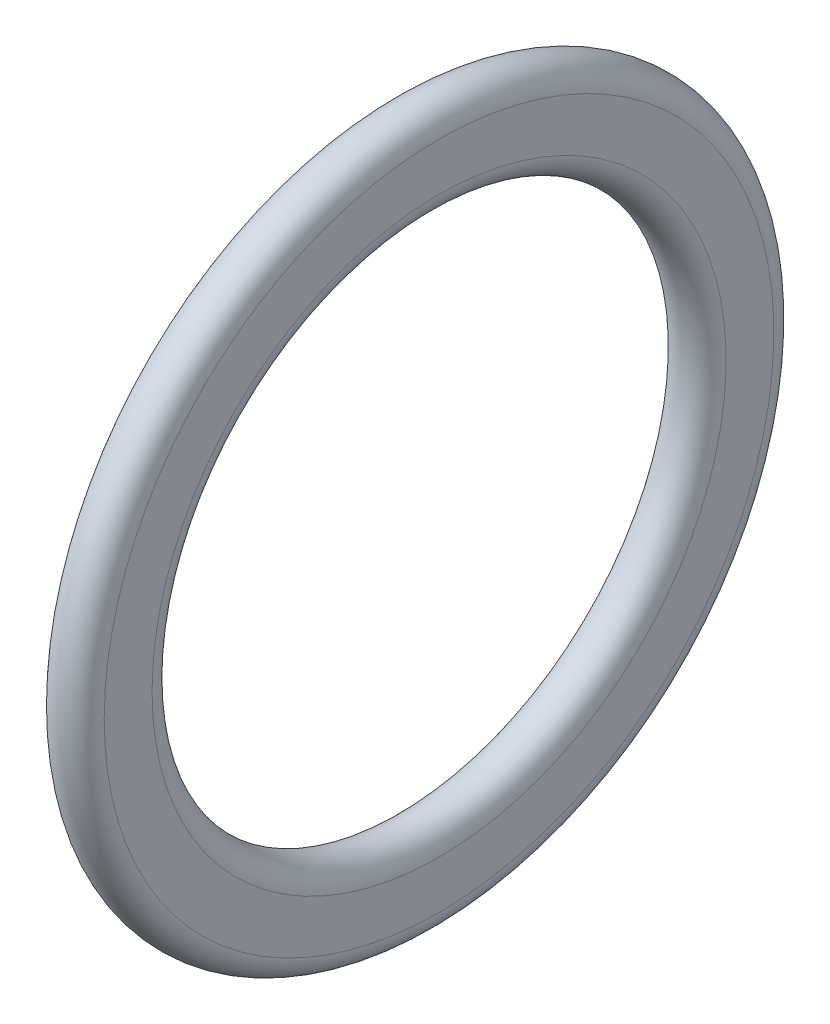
from build123d import *


with BuildPart() as part:
    # Esquisse1 → R_volution1 (revolve)
    with BuildSketch(Plane.XY, mode=Mode.PRIVATE) as r_volution1_sk:
        with BuildLine():
            Line((-0.5, 7), (-0.5, 6))
            ThreePointArc((-0.5, 6), (0, 5.5), (0.5, 6))
            Line((0.5, 6), (0.5, 7))
            ThreePointArc((0.5, 7), (0, 7.5), (-0.5, 7))
        make_face()
    revolve(r_volution1_sk.sketch.rotate(Axis((0, 0, 0), (1, 0, 0)), 90), axis=Axis((0, 0, 0), (1, 0, 0)))


solid = part.part
